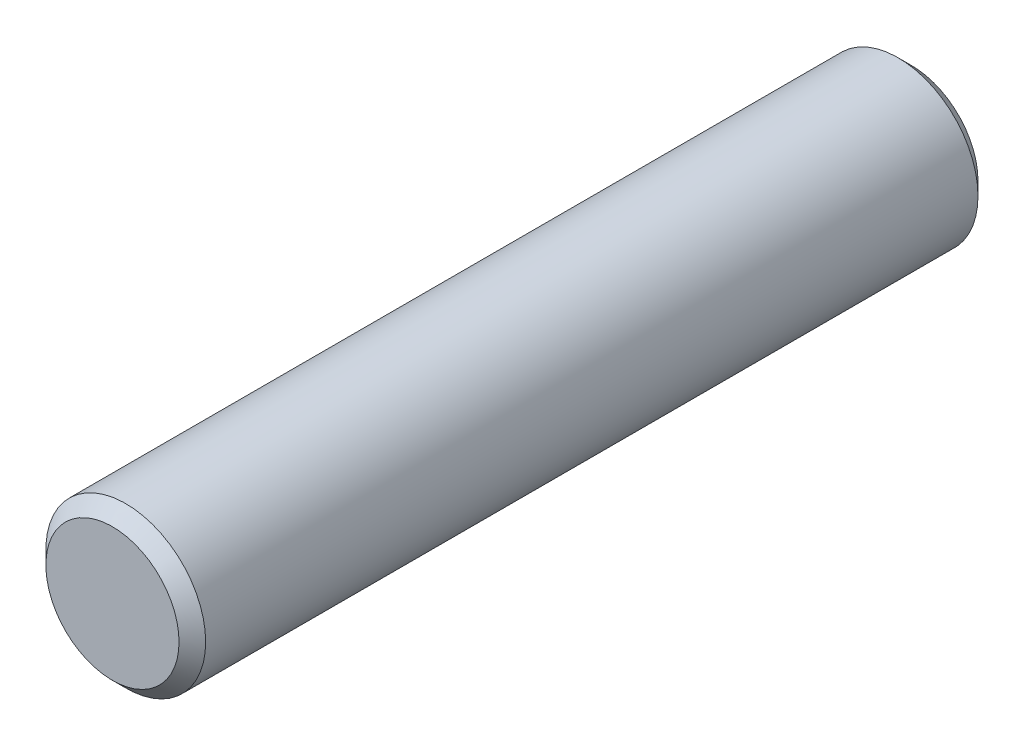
from build123d import *

# Parameters (mm, degrees)
ESQUISSE1_R          = 3
BASE_EXTRUSION_DEPTH = 30
CHANFREIN1_SIZE      = 0.5


with BuildPart() as part:
    # Esquisse1 → Base-Extrusion (new body)
    with BuildSketch(Plane.XY):
        Circle(ESQUISSE1_R)
    extrude(amount=BASE_EXTRUSION_DEPTH)

    # Chanfrein1
    chanfrein1_edges = [part.edges().sort_by_distance(p)[0] for p in [
        (-3, 0, 0),
        (-3, 0, 30),
    ]]
    chamfer(chanfrein1_edges, length=CHANFREIN1_SIZE)


solid = part.part
